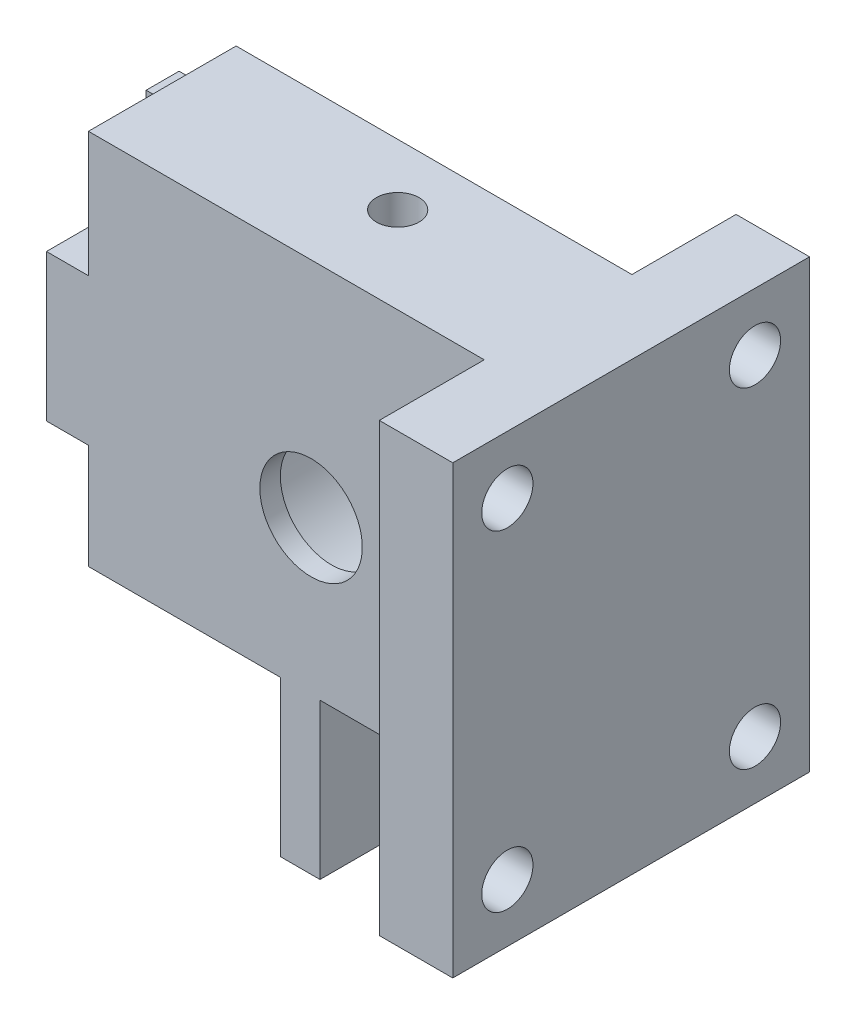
from build123d import *

# Parameters (mm, degrees)
SKETCH1_W                  = 36.3728
SKETCH1_H                  = 27.0002
EXTRUDE1_DEPTH             = 21.59
SKETCH16_W                 = 15.160540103
SKETCH16_H                 = 27.0002
CUT_EXTRUDE5_DEPTH         = 1.778
CUT_EXTRUDE6_DEPTH         = 48.704259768
CUT_EXTRUDE6_DEPTH_BACK    = 48.704259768
SKETCH33_W                 = 39.308087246
SKETCH33_H                 = 13.652047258
SKETCH20_W                 = 28.4178
SKETCH20_H                 = 6.03470191
CUT_EXTRUDE1_DEPTH         = 48.704259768
SKETCH21_W                 = 2.38125
SKETCH21_H                 = 8.89
SENSOR_TAB_DEPTH           = 9.398
SKETCH34_R                 = 6
BALL_NUT_BORE_DEPTH        = 14
F_6_2_6_2_DIAMETER_HOLE1_D = 6.2
SKETCH35_W                 = 10.457625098
SKETCH35_H                 = 7.5692
SKETCH35_H_2               = 11.215144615
CUT_EXTRUDE8_DEPTH         = 49.680453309
CUT_EXTRUDE9_DEPTH         = 50.430752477
CUT_EXTRUDE9_DEPTH_BACK    = 50.430752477
SKETCH36_W                 = 7.180613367
SKETCH36_H                 = 12.231052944
F_3_1_3_1_DIAMETER_HOLE1_D = 3.1
M3_CNTR_BORE_REACH         = 42.28
F_5_40_TAPPED_HOLE1_D      = 2.5781
F_5_40_TAPPED_HOLE1_DEPTH  = 5.1562
F_5_40_TAPPED_HOLE1_TIP    = 0.774539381
M3_5X0_6_TAPPED_HOLE1_D    = 2.9
F_5_40_TAPPED_HOLE2_D      = 2.5781
F_5_40_TAPPED_HOLE2_DEPTH  = 9.525
F_5_40_TAPPED_HOLE2_TIP    = 0.774539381


with BuildPart() as part:
    # Sketch1 → Extrude1 (new body)
    with BuildSketch(Plane.XY):
        with Locations((22.1536, 0)):
            Rectangle(SKETCH1_W, SKETCH1_H)
    extrude(amount=EXTRUDE1_DEPTH)

    # Sketch16 → Cut-Extrude5 (cut)
    with BuildSketch(Plane(origin=(0, 0, 0), x_dir=(-1, 0, 0), z_dir=(0, 0, -1))):
        with Locations((-4.362529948, 0)):
            Rectangle(SKETCH16_W, SKETCH16_H)
    extrude(amount=-CUT_EXTRUDE5_DEPTH, mode=Mode.SUBTRACT)

    # Sketch33 → Cut-Extrude6 (cut, two sides: drawn at the far end of the back side and taken through both)
    with BuildSketch(Plane(origin=(0, 0, 0), x_dir=(1, 0, 0), z_dir=(0, 1, 0)).offset(-CUT_EXTRUDE6_DEPTH_BACK)):
        with Locations((16.240956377, -22.066023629)):
            Rectangle(SKETCH33_W, SKETCH33_H)
    extrude(amount=CUT_EXTRUDE6_DEPTH + CUT_EXTRUDE6_DEPTH_BACK, mode=Mode.SUBTRACT)

    # Sketch20 → Cut-Extrude1 (cut, through all)
    with BuildSketch(Plane(origin=(0, 0, 0), x_dir=(-1, 0, 0), z_dir=(0, 0, -1))):
        with Locations((-18.1761, -12.326450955)):
            Rectangle(SKETCH20_W, SKETCH20_H)
    extrude(amount=-CUT_EXTRUDE1_DEPTH, mode=Mode.SUBTRACT)

    # Sketch21 → Sensor Tab (add)
    with BuildSketch(Plane.XZ.offset(9.3091)):
        with Locations((24.765, 10.795)):
            Rectangle(SKETCH21_W, SKETCH21_H)
    extrude(amount=SENSOR_TAB_DEPTH)

    # Sketch34 → Ball Nut Bore (cut)
    with BuildSketch(Plane(origin=(0, 0, 0), x_dir=(-1, 0, 0), z_dir=(0, 0, -1))):
        with Locations((-25.4175, -0.0127)):
            Circle(SKETCH34_R)
    extrude(amount=-BALL_NUT_BORE_DEPTH, mode=Mode.SUBTRACT)

    # 6.2 _6.2_ Diameter Hole1 (through all)
    with Locations(Plane(origin=(0, 0, 0), x_dir=(-1, 0, 0), z_dir=(0, 0, -1))):
        with Locations((-25.4175, -0.0127)):
            Hole(F_6_2_6_2_DIAMETER_HOLE1_D / 2)

    # Sketch35 → Cut-Extrude8 (cut, through all)
    with BuildSketch(Plane(origin=(0, 0, 1.778), x_dir=(-1, 0, 0), z_dir=(0, 0, -1))):
        with Locations((-6.713987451, 9.7155)):
            Rectangle(SKETCH35_W, SKETCH35_H)
        with Locations((-6.713987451, -8.561592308)):
            Rectangle(SKETCH35_W, SKETCH35_H_2)
    extrude(amount=-CUT_EXTRUDE8_DEPTH, mode=Mode.SUBTRACT)

    # Sketch36 → Cut-Extrude9 (cut, two sides: drawn at the far end of the back side and taken through both)
    with BuildSketch(Plane(origin=(0, 0, 0), x_dir=(1, 0, 0), z_dir=(0, 1, 0)).offset(-CUT_EXTRUDE9_DEPTH_BACK)):
        with Locations((5.812493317, -9.886473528)):
            Rectangle(SKETCH36_W, SKETCH36_H)
    extrude(amount=CUT_EXTRUDE9_DEPTH + CUT_EXTRUDE9_DEPTH_BACK, mode=Mode.SUBTRACT)

    # 3.1 _3.1_ Diameter Hole1 (through all)
    with Locations(Plane(origin=(40.34, 0, 0), x_dir=(0, 0, -1), z_dir=(1, 0, 0))):
        with Locations((-18.288, 9.9949), (-18.288, -9.9949), (-3.302, 9.9949), (-3.302, -9.9949)):
            Hole(F_3_1_3_1_DIAMETER_HOLE1_D / 2)

    # M3 CNTR Bore: up to this face of the body (flat: up to its plane)
    m3_cntr_bore_end = Plane(part.part.faces().sort_by_distance((35.895, 0, 18.427261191))[0])
    # Sketch41 → M3 CNTR Bore (cut, up to the picked face)
    with BuildSketch(Plane.ZY.offset(-11.9428), mode=Mode.PRIVATE) as m3_cntr_bore_sk1:
        with BuildLine():
            Line((3.302, 6.994525), (-5.629417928, 6.994525))
            Line((-5.629417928, 6.994525), (-5.629417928, 17.136264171))
            Line((-5.629417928, 17.136264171), (6.302375, 17.136264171))
            Line((6.302375, 17.136264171), (6.302375, 9.9949))
            ThreePointArc((6.302375, 9.9949), (5.423585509, 7.873314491), (3.302, 6.994525))
        make_face()
    m3_cntr_bore_tool1 = split(extrude(m3_cntr_bore_sk1.sketch, amount=-M3_CNTR_BORE_REACH, mode=Mode.PRIVATE), bisect_by=m3_cntr_bore_end, keep=Keep.BOTH, mode=Mode.PRIVATE)
    # Sketch41 → M3 CNTR Bore (cut, up to the picked face)
    with BuildSketch(Plane.ZY.offset(-11.9428), mode=Mode.PRIVATE) as m3_cntr_bore_sk2:
        with BuildLine():
            Line((6.302374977, -9.994528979), (6.303729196, -20.945837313))
            Line((6.303729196, -20.945837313), (-3.928871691, -20.945837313))
            Line((-3.928871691, -20.945837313), (-3.928871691, -6.994525))
            Line((-3.928871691, -6.994525), (3.302, -6.994525))
            ThreePointArc((3.302, -6.994525), (5.423454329, -7.87318332), (6.302374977, -9.994528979))
        make_face()
    m3_cntr_bore_tool2 = split(extrude(m3_cntr_bore_sk2.sketch, amount=-M3_CNTR_BORE_REACH, mode=Mode.PRIVATE), bisect_by=m3_cntr_bore_end, keep=Keep.BOTH, mode=Mode.PRIVATE)
    add(m3_cntr_bore_tool1.solids().sort_by(Axis((11.9428, 12.136791, 0.250561), (1, 0, 0)))[0], mode=Mode.SUBTRACT)
    add(m3_cntr_bore_tool2.solids().sort_by(Axis((11.9428, -14.056864, 1.126032), (1, 0, 0)))[0], mode=Mode.SUBTRACT)

    # 5-40 Tapped Hole1
    with Locations(Plane.ZY.offset(-11.9428)):
        with Locations((10.795, 9.6901), (10.795, -6.1341)):
            Hole(F_5_40_TAPPED_HOLE1_D / 2, depth=F_5_40_TAPPED_HOLE1_DEPTH)
            with Locations((0, 0, -(F_5_40_TAPPED_HOLE1_DEPTH + F_5_40_TAPPED_HOLE1_TIP / 2))):  # 118° drill point
                Cone(0, F_5_40_TAPPED_HOLE1_D / 2, F_5_40_TAPPED_HOLE1_TIP, mode=Mode.SUBTRACT)

    # M3.5x0.6 Tapped Hole1 (through all)
    with Locations(Plane(origin=(1.837971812, 5.599438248, 1.778), x_dir=(-1, 0, 0), z_dir=(0, 0, -1))):
        with Locations((-4.847028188, -4.113538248)):
            Hole(M3_5X0_6_TAPPED_HOLE1_D / 2)

    # 5-40 Tapped Hole2
    with Locations(Plane(origin=(0, 13.5001, 0), x_dir=(-1, 0, 0), z_dir=(0, 1, 0))):
        with Locations((-25.4175, 10)):
            Hole(F_5_40_TAPPED_HOLE2_D / 2, depth=F_5_40_TAPPED_HOLE2_DEPTH)
            with Locations((0, 0, -(F_5_40_TAPPED_HOLE2_DEPTH + F_5_40_TAPPED_HOLE2_TIP / 2))):  # 118° drill point
                Cone(0, F_5_40_TAPPED_HOLE2_D / 2, F_5_40_TAPPED_HOLE2_TIP, mode=Mode.SUBTRACT)


solid = part.part
